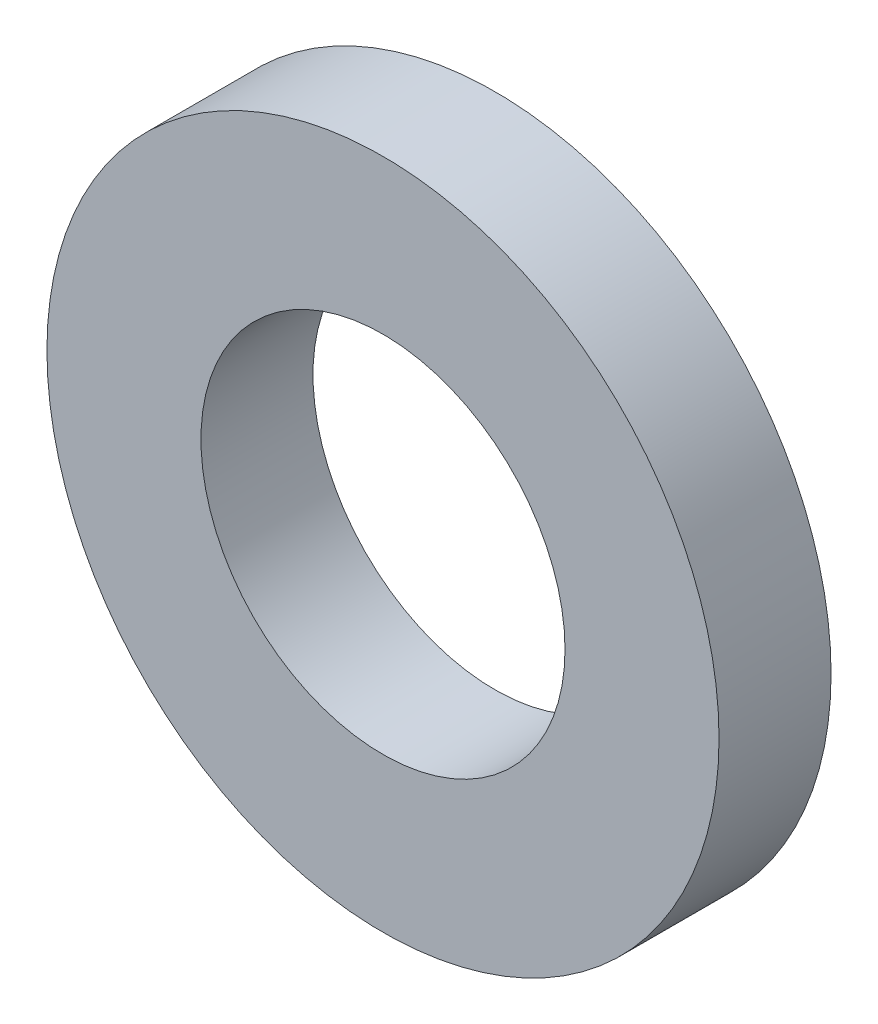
ISO-10303-21;
HEADER;
FILE_DESCRIPTION(('STEP AP214'),'2;1');
FILE_NAME('part.step','',(''),(''),'','','');
FILE_SCHEMA(('AUTOMOTIVE_DESIGN { 1 0 10303 214 1 1 1 1 }'));
ENDSEC;
DATA;
#1=APPLICATION_CONTEXT('core data for automotive mechanical design processes');
#2=APPLICATION_PROTOCOL_DEFINITION('international standard','automotive_design',2000,#1);
#3=PRODUCT_CONTEXT('',#1,'mechanical');
#4=PRODUCT('Part','Part','',(#3));
#5=PRODUCT_RELATED_PRODUCT_CATEGORY('part','',(#4));
#6=PRODUCT_DEFINITION_FORMATION('','',#4);
#7=PRODUCT_DEFINITION_CONTEXT('part definition',#1,'design');
#8=PRODUCT_DEFINITION('design','',#6,#7);
#9=PRODUCT_DEFINITION_SHAPE('','',#8);
#10=(LENGTH_UNIT() NAMED_UNIT(*) SI_UNIT(.MILLI.,.METRE.));
#11=(NAMED_UNIT(*) PLANE_ANGLE_UNIT() SI_UNIT($,.RADIAN.));
#12=(NAMED_UNIT(*) SI_UNIT($,.STERADIAN.) SOLID_ANGLE_UNIT());
#13=UNCERTAINTY_MEASURE_WITH_UNIT(LENGTH_MEASURE(1.E-05),#10,'distance_accuracy_value','');
#14=(GEOMETRIC_REPRESENTATION_CONTEXT(3) GLOBAL_UNCERTAINTY_ASSIGNED_CONTEXT((#13)) GLOBAL_UNIT_ASSIGNED_CONTEXT((#10,
#11,#12)) REPRESENTATION_CONTEXT('',''));
#15=CARTESIAN_POINT('',(0.,0.,0.));
#16=DIRECTION('',(0.,0.,1.));
#17=DIRECTION('',(1.,0.,0.));
#18=AXIS2_PLACEMENT_3D('',#15,#16,#17);
#19=CARTESIAN_POINT('',(0.,0.,12.7));
#20=DIRECTION('',(0.,0.,1.));
#21=DIRECTION('',(1.,0.,0.));
#22=AXIS2_PLACEMENT_3D('',#19,#20,#21);
#23=PLANE('',#22);
#24=CARTESIAN_POINT('',(0.,0.,12.7));
#25=DIRECTION('',(0.,0.,1.));
#26=DIRECTION('',(1.,0.,0.));
#27=AXIS2_PLACEMENT_3D('',#24,#25,#26);
#28=CIRCLE('',#27,38.1);
#29=CARTESIAN_POINT('',(38.1,0.,12.7));
#30=VERTEX_POINT('',#29);
#31=EDGE_CURVE('E10',#30,#30,#28,.T.);
#32=ORIENTED_EDGE('',*,*,#31,.T.);
#33=EDGE_LOOP('',(#32));
#34=FACE_BOUND('',#33,.T.);
#35=CARTESIAN_POINT('',(0.,0.,12.7));
#36=DIRECTION('',(0.,0.,1.));
#37=DIRECTION('',(1.,0.,0.));
#38=AXIS2_PLACEMENT_3D('',#35,#36,#37);
#39=CIRCLE('',#38,20.6375);
#40=CARTESIAN_POINT('',(20.6375,0.,12.7));
#41=VERTEX_POINT('',#40);
#42=EDGE_CURVE('E40',#41,#41,#39,.T.);
#43=ORIENTED_EDGE('',*,*,#42,.F.);
#44=EDGE_LOOP('',(#43));
#45=FACE_BOUND('',#44,.T.);
#46=ADVANCED_FACE('F29',(#34,#45),#23,.T.);
#47=CARTESIAN_POINT('',(0.,0.,0.));
#48=DIRECTION('',(0.,0.,1.));
#49=DIRECTION('',(1.,0.,0.));
#50=AXIS2_PLACEMENT_3D('',#47,#48,#49);
#51=PLANE('',#50);
#52=CARTESIAN_POINT('',(0.,0.,0.));
#53=DIRECTION('',(0.,0.,1.));
#54=DIRECTION('',(1.,0.,0.));
#55=AXIS2_PLACEMENT_3D('',#52,#53,#54);
#56=CIRCLE('',#55,38.1);
#57=CARTESIAN_POINT('',(38.1,0.,0.));
#58=VERTEX_POINT('',#57);
#59=EDGE_CURVE('E36',#58,#58,#56,.T.);
#60=ORIENTED_EDGE('',*,*,#59,.F.);
#61=EDGE_LOOP('',(#60));
#62=FACE_BOUND('',#61,.T.);
#63=CARTESIAN_POINT('',(0.,0.,0.));
#64=DIRECTION('',(0.,0.,1.));
#65=DIRECTION('',(1.,0.,0.));
#66=AXIS2_PLACEMENT_3D('',#63,#64,#65);
#67=CIRCLE('',#66,20.6375);
#68=CARTESIAN_POINT('',(20.6375,0.,0.));
#69=VERTEX_POINT('',#68);
#70=EDGE_CURVE('E44',#69,#69,#67,.T.);
#71=ORIENTED_EDGE('',*,*,#70,.T.);
#72=EDGE_LOOP('',(#71));
#73=FACE_BOUND('',#72,.T.);
#74=ADVANCED_FACE('F50',(#62,#73),#51,.F.);
#75=CARTESIAN_POINT('',(0.,0.,12.7));
#76=DIRECTION('',(0.,0.,-1.));
#77=DIRECTION('',(-1.,0.,0.));
#78=AXIS2_PLACEMENT_3D('',#75,#76,#77);
#79=CYLINDRICAL_SURFACE('',#78,38.1);
#80=ORIENTED_EDGE('',*,*,#31,.F.);
#81=EDGE_LOOP('',(#80));
#82=FACE_BOUND('',#81,.T.);
#83=ORIENTED_EDGE('',*,*,#59,.T.);
#84=EDGE_LOOP('',(#83));
#85=FACE_BOUND('',#84,.T.);
#86=ADVANCED_FACE('F31',(#82,#85),#79,.T.);
#87=CARTESIAN_POINT('',(0.,0.,12.7));
#88=DIRECTION('',(0.,0.,-1.));
#89=DIRECTION('',(-1.,0.,0.));
#90=AXIS2_PLACEMENT_3D('',#87,#88,#89);
#91=CYLINDRICAL_SURFACE('',#90,20.6375);
#92=ORIENTED_EDGE('',*,*,#42,.T.);
#93=EDGE_LOOP('',(#92));
#94=FACE_BOUND('',#93,.T.);
#95=ORIENTED_EDGE('',*,*,#70,.F.);
#96=EDGE_LOOP('',(#95));
#97=FACE_BOUND('',#96,.T.);
#98=ADVANCED_FACE('F52',(#94,#97),#91,.F.);
#99=CLOSED_SHELL('',(#46,#74,#86,#98));
#100=MANIFOLD_SOLID_BREP('B2',#99);
#101=ADVANCED_BREP_SHAPE_REPRESENTATION('',(#18,#100),#14);
#102=SHAPE_DEFINITION_REPRESENTATION(#9,#101);
ENDSEC;
END-ISO-10303-21;
